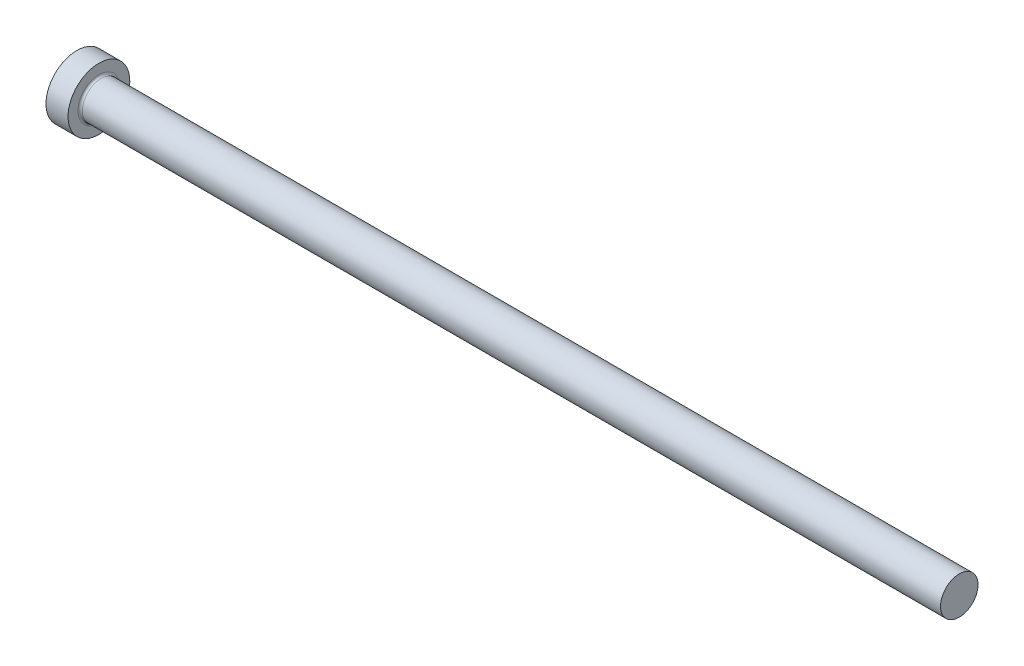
ISO-10303-21;
HEADER;
FILE_DESCRIPTION(('STEP AP214'),'2;1');
FILE_NAME('part.step','',(''),(''),'','','');
FILE_SCHEMA(('AUTOMOTIVE_DESIGN { 1 0 10303 214 1 1 1 1 }'));
ENDSEC;
DATA;
#1=APPLICATION_CONTEXT('core data for automotive mechanical design processes');
#2=APPLICATION_PROTOCOL_DEFINITION('international standard','automotive_design',2000,#1);
#3=PRODUCT_CONTEXT('',#1,'mechanical');
#4=PRODUCT('Part','Part','',(#3));
#5=PRODUCT_RELATED_PRODUCT_CATEGORY('part','',(#4));
#6=PRODUCT_DEFINITION_FORMATION('','',#4);
#7=PRODUCT_DEFINITION_CONTEXT('part definition',#1,'design');
#8=PRODUCT_DEFINITION('design','',#6,#7);
#9=PRODUCT_DEFINITION_SHAPE('','',#8);
#10=(LENGTH_UNIT() NAMED_UNIT(*) SI_UNIT(.MILLI.,.METRE.));
#11=(NAMED_UNIT(*) PLANE_ANGLE_UNIT() SI_UNIT($,.RADIAN.));
#12=(NAMED_UNIT(*) SI_UNIT($,.STERADIAN.) SOLID_ANGLE_UNIT());
#13=UNCERTAINTY_MEASURE_WITH_UNIT(LENGTH_MEASURE(1.E-05),#10,'distance_accuracy_value','');
#14=(GEOMETRIC_REPRESENTATION_CONTEXT(3) GLOBAL_UNCERTAINTY_ASSIGNED_CONTEXT((#13)) GLOBAL_UNIT_ASSIGNED_CONTEXT((#10,
#11,#12)) REPRESENTATION_CONTEXT('',''));
#15=CARTESIAN_POINT('',(0.,0.,0.));
#16=DIRECTION('',(0.,0.,1.));
#17=DIRECTION('',(1.,0.,0.));
#18=AXIS2_PLACEMENT_3D('',#15,#16,#17);
#19=CARTESIAN_POINT('',(0.,0.,0.));
#20=DIRECTION('',(-1.,0.,0.));
#21=DIRECTION('',(0.,-1.,0.));
#22=AXIS2_PLACEMENT_3D('',#19,#20,#21);
#23=PLANE('',#22);
#24=CARTESIAN_POINT('',(0.,0.,0.));
#25=DIRECTION('',(1.,0.,0.));
#26=DIRECTION('',(0.,1.,0.));
#27=AXIS2_PLACEMENT_3D('',#24,#25,#26);
#28=CIRCLE('',#27,7.);
#29=CARTESIAN_POINT('',(0.,7.,0.));
#30=VERTEX_POINT('',#29);
#31=EDGE_CURVE('E25',#30,#30,#28,.T.);
#32=ORIENTED_EDGE('',*,*,#31,.F.);
#33=EDGE_LOOP('',(#32));
#34=FACE_BOUND('',#33,.T.);
#35=ADVANCED_FACE('F14',(#34),#23,.T.);
#36=CARTESIAN_POINT('',(200.,0.,0.));
#37=DIRECTION('',(1.,0.,0.));
#38=DIRECTION('',(0.,1.,0.));
#39=AXIS2_PLACEMENT_3D('',#36,#37,#38);
#40=CYLINDRICAL_SURFACE('',#39,7.);
#41=ORIENTED_EDGE('',*,*,#31,.T.);
#42=EDGE_LOOP('',(#41));
#43=FACE_BOUND('',#42,.T.);
#44=CARTESIAN_POINT('',(5.,0.,0.));
#45=DIRECTION('',(1.,0.,0.));
#46=DIRECTION('',(0.,1.,0.));
#47=AXIS2_PLACEMENT_3D('',#44,#45,#46);
#48=CIRCLE('',#47,7.);
#49=CARTESIAN_POINT('',(5.,7.,0.));
#50=VERTEX_POINT('',#49);
#51=EDGE_CURVE('E29',#50,#50,#48,.T.);
#52=ORIENTED_EDGE('',*,*,#51,.F.);
#53=EDGE_LOOP('',(#52));
#54=FACE_BOUND('',#53,.T.);
#55=ADVANCED_FACE('F51',(#43,#54),#40,.T.);
#56=CARTESIAN_POINT('',(5.,7.,0.));
#57=DIRECTION('',(1.,0.,0.));
#58=DIRECTION('',(0.,1.,0.));
#59=AXIS2_PLACEMENT_3D('',#56,#57,#58);
#60=PLANE('',#59);
#61=CARTESIAN_POINT('',(5.,0.,0.));
#62=DIRECTION('',(1.,0.,0.));
#63=DIRECTION('',(0.,1.,0.));
#64=AXIS2_PLACEMENT_3D('',#61,#62,#63);
#65=CIRCLE('',#64,4.75);
#66=CARTESIAN_POINT('',(5.,4.75,0.));
#67=VERTEX_POINT('',#66);
#68=EDGE_CURVE('E9',#67,#67,#65,.F.);
#69=ORIENTED_EDGE('',*,*,#68,.T.);
#70=EDGE_LOOP('',(#69));
#71=FACE_BOUND('',#70,.T.);
#72=ORIENTED_EDGE('',*,*,#51,.T.);
#73=EDGE_LOOP('',(#72));
#74=FACE_BOUND('',#73,.T.);
#75=ADVANCED_FACE('F42',(#71,#74),#60,.T.);
#76=CARTESIAN_POINT('',(200.,0.,0.));
#77=DIRECTION('',(1.,0.,0.));
#78=DIRECTION('',(0.,1.,0.));
#79=AXIS2_PLACEMENT_3D('',#76,#77,#78);
#80=CYLINDRICAL_SURFACE('',#79,4.24999999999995);
#81=CARTESIAN_POINT('',(5.5,0.,0.));
#82=DIRECTION('',(1.,0.,0.));
#83=DIRECTION('',(0.,1.,0.));
#84=AXIS2_PLACEMENT_3D('',#81,#82,#83);
#85=CIRCLE('',#84,4.24999999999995);
#86=CARTESIAN_POINT('',(5.5,4.24999999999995,0.));
#87=VERTEX_POINT('',#86);
#88=EDGE_CURVE('E21',#87,#87,#85,.T.);
#89=ORIENTED_EDGE('',*,*,#88,.T.);
#90=EDGE_LOOP('',(#89));
#91=FACE_BOUND('',#90,.T.);
#92=CARTESIAN_POINT('',(200.,0.,0.));
#93=DIRECTION('',(1.,0.,0.));
#94=DIRECTION('',(0.,1.,0.));
#95=AXIS2_PLACEMENT_3D('',#92,#93,#94);
#96=CIRCLE('',#95,4.25);
#97=CARTESIAN_POINT('',(200.,4.25000000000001,0.));
#98=VERTEX_POINT('',#97);
#99=EDGE_CURVE('E34',#98,#98,#96,.T.);
#100=ORIENTED_EDGE('',*,*,#99,.F.);
#101=EDGE_LOOP('',(#100));
#102=FACE_BOUND('',#101,.T.);
#103=ADVANCED_FACE('F40',(#91,#102),#80,.T.);
#104=CARTESIAN_POINT('',(200.,4.25,0.));
#105=DIRECTION('',(1.,0.,0.));
#106=DIRECTION('',(0.,1.,0.));
#107=AXIS2_PLACEMENT_3D('',#104,#105,#106);
#108=PLANE('',#107);
#109=ORIENTED_EDGE('',*,*,#99,.T.);
#110=EDGE_LOOP('',(#109));
#111=FACE_BOUND('',#110,.T.);
#112=ADVANCED_FACE('F38',(#111),#108,.T.);
#113=CARTESIAN_POINT('',(5.5,0.,0.));
#114=DIRECTION('',(1.,0.,0.));
#115=DIRECTION('',(0.,1.,0.));
#116=AXIS2_PLACEMENT_3D('',#113,#114,#115);
#117=TOROIDAL_SURFACE('',#116,4.75,0.5);
#118=ORIENTED_EDGE('',*,*,#68,.F.);
#119=EDGE_LOOP('',(#118));
#120=FACE_BOUND('',#119,.T.);
#121=ORIENTED_EDGE('',*,*,#88,.F.);
#122=EDGE_LOOP('',(#121));
#123=FACE_BOUND('',#122,.T.);
#124=ADVANCED_FACE('F16',(#120,#123),#117,.F.);
#125=CLOSED_SHELL('',(#35,#55,#75,#103,#112,#124));
#126=MANIFOLD_SOLID_BREP('B1',#125);
#127=ADVANCED_BREP_SHAPE_REPRESENTATION('',(#18,#126),#14);
#128=SHAPE_DEFINITION_REPRESENTATION(#9,#127);
ENDSEC;
END-ISO-10303-21;
